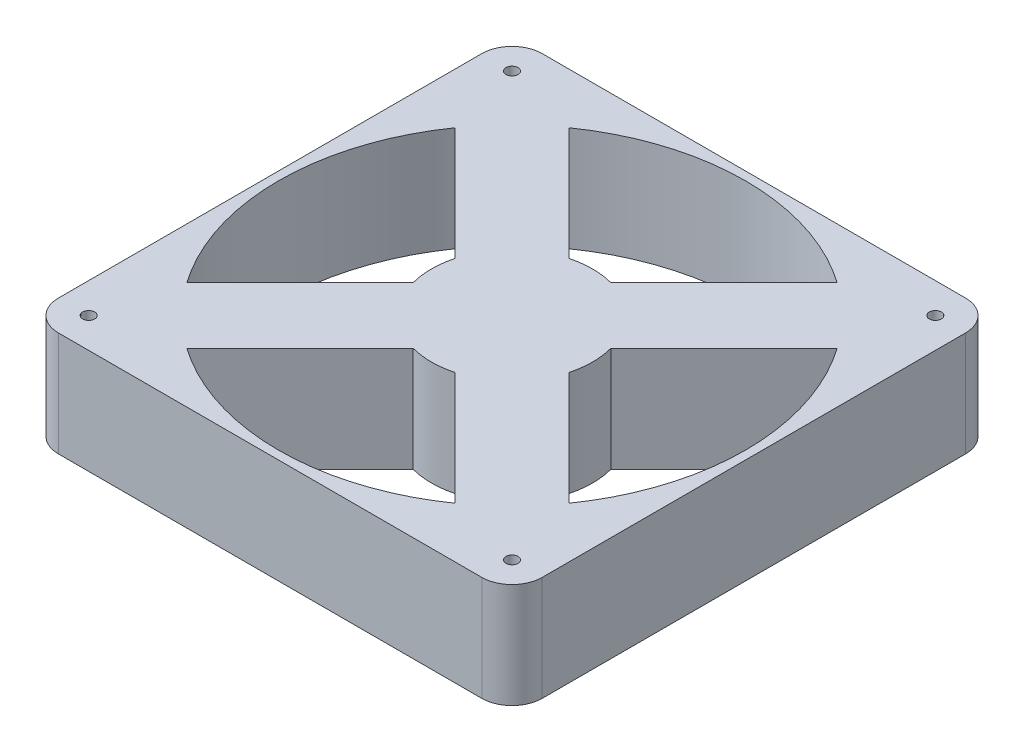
from build123d import *

# Parameters (mm, degrees)
SKIZZE1_R                       = 1.5
AUFSATZ_LINEAR_AUSTRAGEN1_DEPTH = 26


with BuildPart() as part:
    # Skizze1 → Aufsatz-Linear austragen1 (new body)
    with BuildSketch(Plane(origin=(0, 0, 0), x_dir=(1, 0, 0), z_dir=(0, 1, 0))):
        with BuildLine():
            Line((-52.5, 60), (52.5, 60))
            ThreePointArc((52.5, 60), (57.803300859, 57.803300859), (60, 52.5))
            Line((60, 52.5), (60, -52.5))
            ThreePointArc((60, -52.5), (57.803300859, -57.803300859), (52.5, -60))
            Line((52.5, -60), (-52.5, -60))
            ThreePointArc((-52.5, -60), (-57.803300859, -57.803300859), (-60, -52.5))
            Line((-60, -52.5), (-60, 52.5))
            ThreePointArc((-60, 52.5), (-57.803300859, 57.803300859), (-52.5, 60))
        make_face()
        with Locations(Location((-52.5, 52.5, 0), (0, 0, 90))):
            Circle(SKIZZE1_R, mode=Mode.SUBTRACT)
        with Locations(Location((52.5, 52.5, 0), (0, 0, 90))):
            Circle(SKIZZE1_R, mode=Mode.SUBTRACT)
        with Locations(Location((-52.5, -52.5, 0), (0, 0, 90))):
            Circle(SKIZZE1_R, mode=Mode.SUBTRACT)
        with Locations(Location((52.5, -52.5, 0), (0, 0, 90))):
            Circle(SKIZZE1_R, mode=Mode.SUBTRACT)
        with BuildLine():
            Line((19.318516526, -5.176380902), (47.392959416, -33.250823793))
            ThreePointArc((47.392959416, -33.250823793), (57.893953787, 0), (47.392959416, 33.250823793))
            Line((47.392959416, 33.250823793), (19.318516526, 5.176380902))
            ThreePointArc((19.318516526, 5.176380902), (20, 0), (19.318516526, -5.176380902))
        make_face(mode=Mode.SUBTRACT)
        with BuildLine():
            Line((-47.392959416, 33.250823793), (-19.318516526, 5.176380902))
            ThreePointArc((-19.318516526, 5.176380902), (-20, 0), (-19.318516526, -5.176380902))
            Line((-19.318516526, -5.176380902), (-47.392959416, -33.250823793))
            ThreePointArc((-47.392959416, -33.250823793), (-57.893953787, 0), (-47.392959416, 33.250823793))
        make_face(mode=Mode.SUBTRACT)
        with BuildLine():
            Line((-33.250823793, 47.392959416), (-5.176380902, 19.318516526))
            ThreePointArc((-5.176380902, 19.318516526), (0, 20), (5.176380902, 19.318516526))
            Line((5.176380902, 19.318516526), (33.250823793, 47.392959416))
            ThreePointArc((33.250823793, 47.392959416), (0, 57.893953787), (-33.250823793, 47.392959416))
        make_face(mode=Mode.SUBTRACT)
        with BuildLine():
            Line((5.176380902, -19.318516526), (33.250823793, -47.392959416))
            ThreePointArc((33.250823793, -47.392959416), (0, -57.893953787), (-33.250823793, -47.392959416))
            Line((-33.250823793, -47.392959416), (-5.176380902, -19.318516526))
            ThreePointArc((-5.176380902, -19.318516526), (0, -20), (5.176380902, -19.318516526))
        make_face(mode=Mode.SUBTRACT)
    extrude(amount=AUFSATZ_LINEAR_AUSTRAGEN1_DEPTH)


solid = part.part
